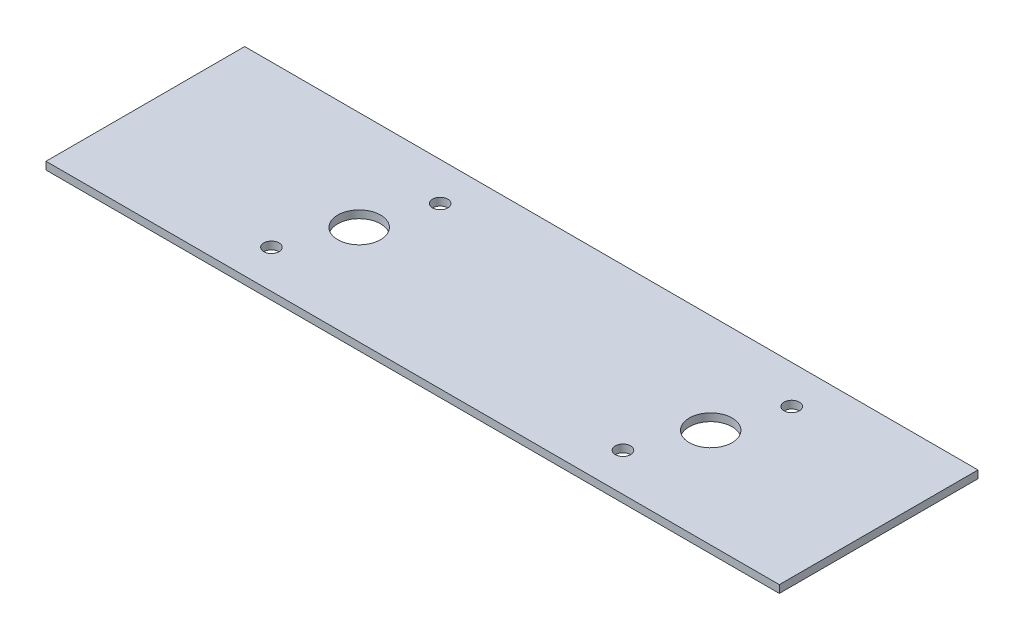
ISO-10303-21;
HEADER;
FILE_DESCRIPTION(('STEP AP214'),'2;1');
FILE_NAME('part.step','',(''),(''),'','','');
FILE_SCHEMA(('AUTOMOTIVE_DESIGN { 1 0 10303 214 1 1 1 1 }'));
ENDSEC;
DATA;
#1=APPLICATION_CONTEXT('core data for automotive mechanical design processes');
#2=APPLICATION_PROTOCOL_DEFINITION('international standard','automotive_design',2000,#1);
#3=PRODUCT_CONTEXT('',#1,'mechanical');
#4=PRODUCT('Part','Part','',(#3));
#5=PRODUCT_RELATED_PRODUCT_CATEGORY('part','',(#4));
#6=PRODUCT_DEFINITION_FORMATION('','',#4);
#7=PRODUCT_DEFINITION_CONTEXT('part definition',#1,'design');
#8=PRODUCT_DEFINITION('design','',#6,#7);
#9=PRODUCT_DEFINITION_SHAPE('','',#8);
#10=(LENGTH_UNIT() NAMED_UNIT(*) SI_UNIT(.MILLI.,.METRE.));
#11=(NAMED_UNIT(*) PLANE_ANGLE_UNIT() SI_UNIT($,.RADIAN.));
#12=(NAMED_UNIT(*) SI_UNIT($,.STERADIAN.) SOLID_ANGLE_UNIT());
#13=UNCERTAINTY_MEASURE_WITH_UNIT(LENGTH_MEASURE(1.E-05),#10,'distance_accuracy_value','');
#14=(GEOMETRIC_REPRESENTATION_CONTEXT(3) GLOBAL_UNCERTAINTY_ASSIGNED_CONTEXT((#13)) GLOBAL_UNIT_ASSIGNED_CONTEXT((#10,
#11,#12)) REPRESENTATION_CONTEXT('',''));
#15=CARTESIAN_POINT('',(0.,0.,0.));
#16=DIRECTION('',(0.,0.,1.));
#17=DIRECTION('',(1.,0.,0.));
#18=AXIS2_PLACEMENT_3D('',#15,#16,#17);
#19=CARTESIAN_POINT('',(-912.202870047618,405.387122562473,1256.08915146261));
#20=DIRECTION('',(1.,0.,0.));
#21=DIRECTION('',(0.,1.,0.));
#22=AXIS2_PLACEMENT_3D('',#19,#20,#21);
#23=PLANE('',#22);
#24=DIRECTION('',(0.,0.,1.));
#25=VECTOR('',#24,1.);
#26=CARTESIAN_POINT('',(-912.202870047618,402.212122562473,1256.08915146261));
#27=LINE('',#26,#25);
#28=CARTESIAN_POINT('',(-912.202870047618,402.212122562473,1256.08915146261));
#29=VERTEX_POINT('',#28);
#30=CARTESIAN_POINT('',(-912.202870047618,402.212122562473,1338.63915146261));
#31=VERTEX_POINT('',#30);
#32=EDGE_CURVE('E105',#29,#31,#27,.T.);
#33=ORIENTED_EDGE('',*,*,#32,.T.);
#34=DIRECTION('',(0.,-1.,0.));
#35=VECTOR('',#34,1.);
#36=CARTESIAN_POINT('',(-912.202870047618,405.387122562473,1338.63915146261));
#37=LINE('',#36,#35);
#38=CARTESIAN_POINT('',(-912.202870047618,405.387122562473,1338.63915146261));
#39=VERTEX_POINT('',#38);
#40=EDGE_CURVE('E11',#39,#31,#37,.T.);
#41=ORIENTED_EDGE('',*,*,#40,.F.);
#42=DIRECTION('',(0.,0.,1.));
#43=VECTOR('',#42,1.);
#44=CARTESIAN_POINT('',(-912.202870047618,405.387122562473,1256.08915146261));
#45=LINE('',#44,#43);
#46=CARTESIAN_POINT('',(-912.202870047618,405.387122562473,1256.08915146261));
#47=VERTEX_POINT('',#46);
#48=EDGE_CURVE('E89',#47,#39,#45,.T.);
#49=ORIENTED_EDGE('',*,*,#48,.F.);
#50=DIRECTION('',(0.,-1.,0.));
#51=VECTOR('',#50,1.);
#52=CARTESIAN_POINT('',(-912.202870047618,405.387122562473,1256.08915146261));
#53=LINE('',#52,#51);
#54=EDGE_CURVE('E96',#47,#29,#53,.T.);
#55=ORIENTED_EDGE('',*,*,#54,.T.);
#56=EDGE_LOOP('',(#33,#41,#49,#55));
#57=FACE_BOUND('',#56,.T.);
#58=ADVANCED_FACE('F39',(#57),#23,.F.);
#59=CARTESIAN_POINT('',(-912.202870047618,405.387122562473,1338.63915146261));
#60=DIRECTION('',(0.,0.,-1.));
#61=DIRECTION('',(0.,1.,0.));
#62=AXIS2_PLACEMENT_3D('',#59,#60,#61);
#63=PLANE('',#62);
#64=DIRECTION('',(1.,0.,0.));
#65=VECTOR('',#64,1.);
#66=CARTESIAN_POINT('',(-912.202870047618,402.212122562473,1338.63915146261));
#67=LINE('',#66,#65);
#68=CARTESIAN_POINT('',(-607.540370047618,402.212122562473,1338.63915146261));
#69=VERTEX_POINT('',#68);
#70=EDGE_CURVE('E93',#31,#69,#67,.T.);
#71=ORIENTED_EDGE('',*,*,#70,.T.);
#72=DIRECTION('',(0.,-1.,0.));
#73=VECTOR('',#72,1.);
#74=CARTESIAN_POINT('',(-607.540370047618,405.387122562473,1338.63915146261));
#75=LINE('',#74,#73);
#76=CARTESIAN_POINT('',(-607.540370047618,405.387122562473,1338.63915146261));
#77=VERTEX_POINT('',#76);
#78=EDGE_CURVE('E50',#77,#69,#75,.T.);
#79=ORIENTED_EDGE('',*,*,#78,.F.);
#80=DIRECTION('',(1.,0.,0.));
#81=VECTOR('',#80,1.);
#82=CARTESIAN_POINT('',(-912.202870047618,405.387122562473,1338.63915146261));
#83=LINE('',#82,#81);
#84=EDGE_CURVE('E83',#39,#77,#83,.T.);
#85=ORIENTED_EDGE('',*,*,#84,.F.);
#86=ORIENTED_EDGE('',*,*,#40,.T.);
#87=EDGE_LOOP('',(#71,#79,#85,#86));
#88=FACE_BOUND('',#87,.T.);
#89=ADVANCED_FACE('F95',(#88),#63,.F.);
#90=CARTESIAN_POINT('',(-607.540370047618,405.387122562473,1338.63915146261));
#91=DIRECTION('',(-1.,0.,0.));
#92=DIRECTION('',(0.,-1.,0.));
#93=AXIS2_PLACEMENT_3D('',#90,#91,#92);
#94=PLANE('',#93);
#95=DIRECTION('',(0.,0.,-1.));
#96=VECTOR('',#95,1.);
#97=CARTESIAN_POINT('',(-607.540370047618,402.212122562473,1338.63915146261));
#98=LINE('',#97,#96);
#99=CARTESIAN_POINT('',(-607.540370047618,402.212122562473,1256.08915146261));
#100=VERTEX_POINT('',#99);
#101=EDGE_CURVE('E71',#69,#100,#98,.T.);
#102=ORIENTED_EDGE('',*,*,#101,.T.);
#103=DIRECTION('',(0.,-1.,0.));
#104=VECTOR('',#103,1.);
#105=CARTESIAN_POINT('',(-607.540370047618,405.387122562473,1256.08915146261));
#106=LINE('',#105,#104);
#107=CARTESIAN_POINT('',(-607.540370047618,405.387122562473,1256.08915146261));
#108=VERTEX_POINT('',#107);
#109=EDGE_CURVE('E92',#108,#100,#106,.T.);
#110=ORIENTED_EDGE('',*,*,#109,.F.);
#111=DIRECTION('',(0.,0.,-1.));
#112=VECTOR('',#111,1.);
#113=CARTESIAN_POINT('',(-607.540370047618,405.387122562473,1338.63915146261));
#114=LINE('',#113,#112);
#115=EDGE_CURVE('E88',#77,#108,#114,.T.);
#116=ORIENTED_EDGE('',*,*,#115,.F.);
#117=ORIENTED_EDGE('',*,*,#78,.T.);
#118=EDGE_LOOP('',(#102,#110,#116,#117));
#119=FACE_BOUND('',#118,.T.);
#120=ADVANCED_FACE('F98',(#119),#94,.F.);
#121=CARTESIAN_POINT('',(-607.540370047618,405.387122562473,1256.08915146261));
#122=DIRECTION('',(0.,0.,1.));
#123=DIRECTION('',(1.,0.,0.));
#124=AXIS2_PLACEMENT_3D('',#121,#122,#123);
#125=PLANE('',#124);
#126=DIRECTION('',(-1.,0.,0.));
#127=VECTOR('',#126,1.);
#128=CARTESIAN_POINT('',(-607.540370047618,402.212122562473,1256.08915146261));
#129=LINE('',#128,#127);
#130=EDGE_CURVE('E76',#100,#29,#129,.T.);
#131=ORIENTED_EDGE('',*,*,#130,.T.);
#132=ORIENTED_EDGE('',*,*,#54,.F.);
#133=DIRECTION('',(-1.,0.,0.));
#134=VECTOR('',#133,1.);
#135=CARTESIAN_POINT('',(-607.540370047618,405.387122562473,1256.08915146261));
#136=LINE('',#135,#134);
#137=EDGE_CURVE('E54',#108,#47,#136,.T.);
#138=ORIENTED_EDGE('',*,*,#137,.F.);
#139=ORIENTED_EDGE('',*,*,#109,.T.);
#140=EDGE_LOOP('',(#131,#132,#138,#139));
#141=FACE_BOUND('',#140,.T.);
#142=ADVANCED_FACE('F109',(#141),#125,.F.);
#143=CARTESIAN_POINT('',(0.,405.387122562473,0.));
#144=DIRECTION('',(0.,1.,0.));
#145=DIRECTION('',(0.,0.,1.));
#146=AXIS2_PLACEMENT_3D('',#143,#144,#145);
#147=PLANE('',#146);
#148=CARTESIAN_POINT('',(-834.418620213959,405.387122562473,1322.76415139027));
#149=DIRECTION('',(0.,1.,0.));
#150=DIRECTION('',(0.,0.,1.));
#151=AXIS2_PLACEMENT_3D('',#148,#149,#150);
#152=CIRCLE('',#151,3.17500000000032);
#153=CARTESIAN_POINT('',(-834.418620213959,405.387122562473,1325.93915139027));
#154=VERTEX_POINT('',#153);
#155=EDGE_CURVE('E119',#154,#154,#152,.T.);
#156=ORIENTED_EDGE('',*,*,#155,.F.);
#157=EDGE_LOOP('',(#156));
#158=FACE_BOUND('',#157,.T.);
#159=CARTESIAN_POINT('',(-815.118619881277,405.387122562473,1271.96415151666));
#160=DIRECTION('',(0.,1.,0.));
#161=DIRECTION('',(0.,0.,1.));
#162=AXIS2_PLACEMENT_3D('',#159,#160,#161);
#163=CIRCLE('',#162,3.17500000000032);
#164=CARTESIAN_POINT('',(-815.118619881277,405.387122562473,1275.13915151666));
#165=VERTEX_POINT('',#164);
#166=EDGE_CURVE('E128',#165,#165,#163,.T.);
#167=ORIENTED_EDGE('',*,*,#166,.F.);
#168=EDGE_LOOP('',(#167));
#169=FACE_BOUND('',#168,.T.);
#170=CARTESIAN_POINT('',(-688.368620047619,405.387122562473,1322.76415146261));
#171=DIRECTION('',(0.,1.,0.));
#172=DIRECTION('',(0.,0.,1.));
#173=AXIS2_PLACEMENT_3D('',#170,#171,#172);
#174=CIRCLE('',#173,3.17500000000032);
#175=CARTESIAN_POINT('',(-688.368620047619,405.387122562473,1325.93915146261));
#176=VERTEX_POINT('',#175);
#177=EDGE_CURVE('E133',#176,#176,#174,.T.);
#178=ORIENTED_EDGE('',*,*,#177,.F.);
#179=EDGE_LOOP('',(#178));
#180=FACE_BOUND('',#179,.T.);
#181=CARTESIAN_POINT('',(-669.068620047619,405.387122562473,1271.96415146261));
#182=DIRECTION('',(0.,1.,0.));
#183=DIRECTION('',(0.,0.,1.));
#184=AXIS2_PLACEMENT_3D('',#181,#182,#183);
#185=CIRCLE('',#184,3.17500000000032);
#186=CARTESIAN_POINT('',(-669.068620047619,405.387122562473,1275.13915146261));
#187=VERTEX_POINT('',#186);
#188=EDGE_CURVE('E139',#187,#187,#185,.T.);
#189=ORIENTED_EDGE('',*,*,#188,.F.);
#190=EDGE_LOOP('',(#189));
#191=FACE_BOUND('',#190,.T.);
#192=CARTESIAN_POINT('',(-823.371620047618,405.387122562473,1297.36415146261));
#193=DIRECTION('',(0.,1.,0.));
#194=DIRECTION('',(0.,0.,1.));
#195=AXIS2_PLACEMENT_3D('',#192,#193,#194);
#196=CIRCLE('',#195,8.88999999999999);
#197=CARTESIAN_POINT('',(-823.371620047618,405.387122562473,1306.25415146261));
#198=VERTEX_POINT('',#197);
#199=EDGE_CURVE('E124',#198,#198,#196,.T.);
#200=ORIENTED_EDGE('',*,*,#199,.F.);
#201=EDGE_LOOP('',(#200));
#202=FACE_BOUND('',#201,.T.);
#203=CARTESIAN_POINT('',(-677.321620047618,405.387122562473,1297.36415146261));
#204=DIRECTION('',(0.,1.,0.));
#205=DIRECTION('',(0.,0.,1.));
#206=AXIS2_PLACEMENT_3D('',#203,#204,#205);
#207=CIRCLE('',#206,8.88999999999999);
#208=CARTESIAN_POINT('',(-677.321620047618,405.387122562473,1306.25415146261));
#209=VERTEX_POINT('',#208);
#210=EDGE_CURVE('E118',#209,#209,#207,.T.);
#211=ORIENTED_EDGE('',*,*,#210,.F.);
#212=EDGE_LOOP('',(#211));
#213=FACE_BOUND('',#212,.T.);
#214=ORIENTED_EDGE('',*,*,#48,.T.);
#215=ORIENTED_EDGE('',*,*,#84,.T.);
#216=ORIENTED_EDGE('',*,*,#115,.T.);
#217=ORIENTED_EDGE('',*,*,#137,.T.);
#218=EDGE_LOOP('',(#214,#215,#216,#217));
#219=FACE_BOUND('',#218,.T.);
#220=ADVANCED_FACE('F86',(#158,#169,#180,#191,#202,#213,#219),#147,.T.);
#221=CARTESIAN_POINT('',(0.,402.212122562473,0.));
#222=DIRECTION('',(0.,1.,0.));
#223=DIRECTION('',(0.,0.,1.));
#224=AXIS2_PLACEMENT_3D('',#221,#222,#223);
#225=PLANE('',#224);
#226=CARTESIAN_POINT('',(-834.418620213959,402.212122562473,1322.76415139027));
#227=DIRECTION('',(0.,-1.,0.));
#228=DIRECTION('',(0.,0.,-1.));
#229=AXIS2_PLACEMENT_3D('',#226,#227,#228);
#230=CIRCLE('',#229,3.17500000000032);
#231=CARTESIAN_POINT('',(-834.418620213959,402.212122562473,1319.58915139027));
#232=VERTEX_POINT('',#231);
#233=EDGE_CURVE('E138',#232,#232,#230,.T.);
#234=ORIENTED_EDGE('',*,*,#233,.F.);
#235=EDGE_LOOP('',(#234));
#236=FACE_BOUND('',#235,.T.);
#237=CARTESIAN_POINT('',(-815.118619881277,402.212122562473,1271.96415151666));
#238=DIRECTION('',(0.,-1.,0.));
#239=DIRECTION('',(0.,0.,-1.));
#240=AXIS2_PLACEMENT_3D('',#237,#238,#239);
#241=CIRCLE('',#240,3.17500000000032);
#242=CARTESIAN_POINT('',(-815.118619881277,402.212122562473,1268.78915151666));
#243=VERTEX_POINT('',#242);
#244=EDGE_CURVE('E147',#243,#243,#241,.T.);
#245=ORIENTED_EDGE('',*,*,#244,.F.);
#246=EDGE_LOOP('',(#245));
#247=FACE_BOUND('',#246,.T.);
#248=CARTESIAN_POINT('',(-688.368620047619,402.212122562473,1322.76415146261));
#249=DIRECTION('',(0.,-1.,0.));
#250=DIRECTION('',(0.,0.,-1.));
#251=AXIS2_PLACEMENT_3D('',#248,#249,#250);
#252=CIRCLE('',#251,3.17500000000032);
#253=CARTESIAN_POINT('',(-688.368620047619,402.212122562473,1319.58915146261));
#254=VERTEX_POINT('',#253);
#255=EDGE_CURVE('E141',#254,#254,#252,.T.);
#256=ORIENTED_EDGE('',*,*,#255,.F.);
#257=EDGE_LOOP('',(#256));
#258=FACE_BOUND('',#257,.T.);
#259=CARTESIAN_POINT('',(-669.068620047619,402.212122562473,1271.96415146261));
#260=DIRECTION('',(0.,-1.,0.));
#261=DIRECTION('',(0.,0.,-1.));
#262=AXIS2_PLACEMENT_3D('',#259,#260,#261);
#263=CIRCLE('',#262,3.17500000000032);
#264=CARTESIAN_POINT('',(-669.068620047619,402.212122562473,1268.78915146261));
#265=VERTEX_POINT('',#264);
#266=EDGE_CURVE('E137',#265,#265,#263,.T.);
#267=ORIENTED_EDGE('',*,*,#266,.F.);
#268=EDGE_LOOP('',(#267));
#269=FACE_BOUND('',#268,.T.);
#270=CARTESIAN_POINT('',(-823.371620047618,402.212122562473,1297.36415146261));
#271=DIRECTION('',(0.,1.,0.));
#272=DIRECTION('',(0.,0.,1.));
#273=AXIS2_PLACEMENT_3D('',#270,#271,#272);
#274=CIRCLE('',#273,8.88999999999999);
#275=CARTESIAN_POINT('',(-823.371620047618,402.212122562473,1306.25415146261));
#276=VERTEX_POINT('',#275);
#277=EDGE_CURVE('E102',#276,#276,#274,.T.);
#278=ORIENTED_EDGE('',*,*,#277,.T.);
#279=EDGE_LOOP('',(#278));
#280=FACE_BOUND('',#279,.T.);
#281=CARTESIAN_POINT('',(-677.321620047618,402.212122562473,1297.36415146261));
#282=DIRECTION('',(0.,1.,0.));
#283=DIRECTION('',(0.,0.,1.));
#284=AXIS2_PLACEMENT_3D('',#281,#282,#283);
#285=CIRCLE('',#284,8.88999999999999);
#286=CARTESIAN_POINT('',(-677.321620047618,402.212122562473,1306.25415146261));
#287=VERTEX_POINT('',#286);
#288=EDGE_CURVE('E116',#287,#287,#285,.T.);
#289=ORIENTED_EDGE('',*,*,#288,.T.);
#290=EDGE_LOOP('',(#289));
#291=FACE_BOUND('',#290,.T.);
#292=ORIENTED_EDGE('',*,*,#32,.F.);
#293=ORIENTED_EDGE('',*,*,#130,.F.);
#294=ORIENTED_EDGE('',*,*,#101,.F.);
#295=ORIENTED_EDGE('',*,*,#70,.F.);
#296=EDGE_LOOP('',(#292,#293,#294,#295));
#297=FACE_BOUND('',#296,.T.);
#298=ADVANCED_FACE('F113',(#236,#247,#258,#269,#280,#291,#297),#225,.F.);
#299=CARTESIAN_POINT('',(-677.321620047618,402.212122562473,1297.36415146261));
#300=DIRECTION('',(0.,1.,0.));
#301=DIRECTION('',(0.,0.,1.));
#302=AXIS2_PLACEMENT_3D('',#299,#300,#301);
#303=CYLINDRICAL_SURFACE('',#302,8.88999999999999);
#304=ORIENTED_EDGE('',*,*,#288,.F.);
#305=EDGE_LOOP('',(#304));
#306=FACE_BOUND('',#305,.T.);
#307=ORIENTED_EDGE('',*,*,#210,.T.);
#308=EDGE_LOOP('',(#307));
#309=FACE_BOUND('',#308,.T.);
#310=ADVANCED_FACE('F159',(#306,#309),#303,.F.);
#311=CARTESIAN_POINT('',(-823.371620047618,402.212122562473,1297.36415146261));
#312=DIRECTION('',(0.,1.,0.));
#313=DIRECTION('',(0.,0.,1.));
#314=AXIS2_PLACEMENT_3D('',#311,#312,#313);
#315=CYLINDRICAL_SURFACE('',#314,8.88999999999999);
#316=ORIENTED_EDGE('',*,*,#277,.F.);
#317=EDGE_LOOP('',(#316));
#318=FACE_BOUND('',#317,.T.);
#319=ORIENTED_EDGE('',*,*,#199,.T.);
#320=EDGE_LOOP('',(#319));
#321=FACE_BOUND('',#320,.T.);
#322=ADVANCED_FACE('F167',(#318,#321),#315,.F.);
#323=CARTESIAN_POINT('',(-669.068620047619,414.912122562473,1271.96415146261));
#324=DIRECTION('',(0.,-1.,0.));
#325=DIRECTION('',(0.,0.,-1.));
#326=AXIS2_PLACEMENT_3D('',#323,#324,#325);
#327=CYLINDRICAL_SURFACE('',#326,3.17500000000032);
#328=ORIENTED_EDGE('',*,*,#188,.T.);
#329=EDGE_LOOP('',(#328));
#330=FACE_BOUND('',#329,.T.);
#331=ORIENTED_EDGE('',*,*,#266,.T.);
#332=EDGE_LOOP('',(#331));
#333=FACE_BOUND('',#332,.T.);
#334=ADVANCED_FACE('F208',(#330,#333),#327,.F.);
#335=CARTESIAN_POINT('',(-688.368620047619,414.912122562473,1322.76415146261));
#336=DIRECTION('',(0.,-1.,0.));
#337=DIRECTION('',(0.,0.,-1.));
#338=AXIS2_PLACEMENT_3D('',#335,#336,#337);
#339=CYLINDRICAL_SURFACE('',#338,3.17500000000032);
#340=ORIENTED_EDGE('',*,*,#177,.T.);
#341=EDGE_LOOP('',(#340));
#342=FACE_BOUND('',#341,.T.);
#343=ORIENTED_EDGE('',*,*,#255,.T.);
#344=EDGE_LOOP('',(#343));
#345=FACE_BOUND('',#344,.T.);
#346=ADVANCED_FACE('F225',(#342,#345),#339,.F.);
#347=CARTESIAN_POINT('',(-815.118619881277,414.912122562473,1271.96415151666));
#348=DIRECTION('',(0.,-1.,0.));
#349=DIRECTION('',(0.,0.,-1.));
#350=AXIS2_PLACEMENT_3D('',#347,#348,#349);
#351=CYLINDRICAL_SURFACE('',#350,3.17500000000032);
#352=ORIENTED_EDGE('',*,*,#166,.T.);
#353=EDGE_LOOP('',(#352));
#354=FACE_BOUND('',#353,.T.);
#355=ORIENTED_EDGE('',*,*,#244,.T.);
#356=EDGE_LOOP('',(#355));
#357=FACE_BOUND('',#356,.T.);
#358=ADVANCED_FACE('F231',(#354,#357),#351,.F.);
#359=CARTESIAN_POINT('',(-834.418620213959,414.912122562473,1322.76415139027));
#360=DIRECTION('',(0.,-1.,0.));
#361=DIRECTION('',(0.,0.,-1.));
#362=AXIS2_PLACEMENT_3D('',#359,#360,#361);
#363=CYLINDRICAL_SURFACE('',#362,3.17500000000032);
#364=ORIENTED_EDGE('',*,*,#155,.T.);
#365=EDGE_LOOP('',(#364));
#366=FACE_BOUND('',#365,.T.);
#367=ORIENTED_EDGE('',*,*,#233,.T.);
#368=EDGE_LOOP('',(#367));
#369=FACE_BOUND('',#368,.T.);
#370=ADVANCED_FACE('F155',(#366,#369),#363,.F.);
#371=CLOSED_SHELL('',(#58,#89,#120,#142,#220,#298,#310,#322,#334,#346,#358,#370));
#372=MANIFOLD_SOLID_BREP('B2',#371);
#373=ADVANCED_BREP_SHAPE_REPRESENTATION('',(#18,#372),#14);
#374=SHAPE_DEFINITION_REPRESENTATION(#9,#373);
ENDSEC;
END-ISO-10303-21;
